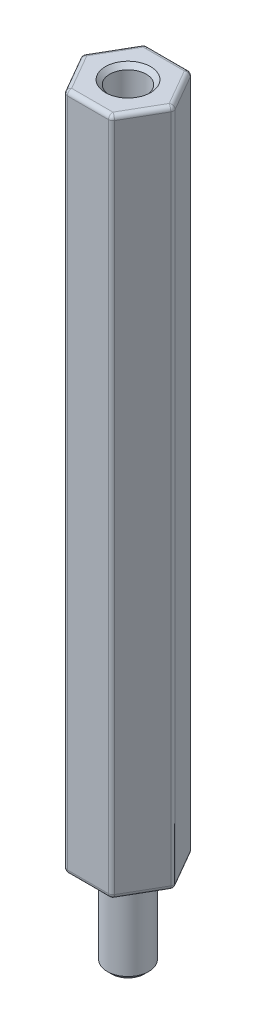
from build123d import *

# Parameters (mm, degrees)
SKETCH1_R           = 1.25
BOSS_EXTRUDE1_DEPTH = 46.6
FILLET1_R           = 0.3
FILLET2_R           = 0.3
SKETCH2_R           = 1.425
BOSS_EXTRUDE2_DEPTH = 6
CHAMFER1_SIZE       = 0.3
FILLET3_R           = 0.3


with BuildPart() as part:
    # Sketch1 → Boss-Extrude1 (new body)
    with BuildSketch(Plane(origin=(0, 0, 0), x_dir=(1, 0, 0), z_dir=(0, 1, 0))):
        Polygon((-1.58771324, 2.75), (-3.175426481, 0), (-1.58771324, -2.75), (1.58771324, -2.75), (3.175426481, 0), (1.58771324, 2.75), align=None)
        with Locations(Location((0, 0, 0), (0, 0, 270))):
            Circle(SKETCH1_R, mode=Mode.SUBTRACT)
    extrude(amount=BOSS_EXTRUDE1_DEPTH)

    # Fillet1
    fillet1_edges = [part.edges().sort_by_distance(p)[0] for p in [
        (1.58771324, 23.3, -2.75),
        (3.175426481, 23.3, 0),
        (1.58771324, 23.3, 2.75),
        (-1.58771324, 23.3, 2.75),
        (-3.175426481, 23.3, 0),
        (-1.58771324, 23.3, -2.75),
    ]]
    fillet(fillet1_edges, radius=FILLET1_R)

    # Fillet2
    fillet2_edges = [part.edges().sort_by_distance(p)[0] for p in [
        (0, 0, -2.75),
        (0, 46.6, -2.75),
        (2.38156986, 0, -1.375),
        (2.38156986, 0, 1.375),
        (0, 0, 2.75),
        (-2.38156986, 0, 1.375),
        (-2.38156986, 0, -1.375),
        (1.56450816, 0, 2.709807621),
        (-1.56450816, 0, 2.709807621),
        (-3.129016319, 0, 0),
        (-1.56450816, 0, -2.709807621),
        (3.129016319, 0, 0),
        (1.56450816, 0, -2.709807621),
        (2.38156986, 46.6, -1.375),
        (-2.38156986, 46.6, -1.375),
        (-2.38156986, 46.6, 1.375),
        (0, 46.6, 2.75),
        (2.38156986, 46.6, 1.375),
        (1.56450816, 46.6, 2.709807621),
        (-1.56450816, 46.6, 2.709807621),
        (-3.129016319, 46.6, 0),
        (-1.56450816, 46.6, -2.709807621),
        (3.129016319, 46.6, 0),
        (1.56450816, 46.6, -2.709807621),
    ]]
    fillet(fillet2_edges, radius=FILLET2_R)

    # Sketch2 → Boss-Extrude2 (add)
    with BuildSketch(Plane.XZ):
        with Locations(Location((0, 0, 0), (0, 0, 90))):
            Circle(SKETCH2_R)
    extrude(amount=BOSS_EXTRUDE2_DEPTH)

    # Chamfer1
    chamfer1_edges = [part.edges().sort_by_distance(p)[0] for p in [
        (0, -6, -1.425),
        (0, 46.6, -1.25),
    ]]
    chamfer(chamfer1_edges, length=CHAMFER1_SIZE)

    # Fillet3
    fillet3_edges = [part.edges().sort_by_distance(p)[0] for p in [
        (0, 0, -1.425),
    ]]
    fillet(fillet3_edges, radius=FILLET3_R)


solid = part.part
